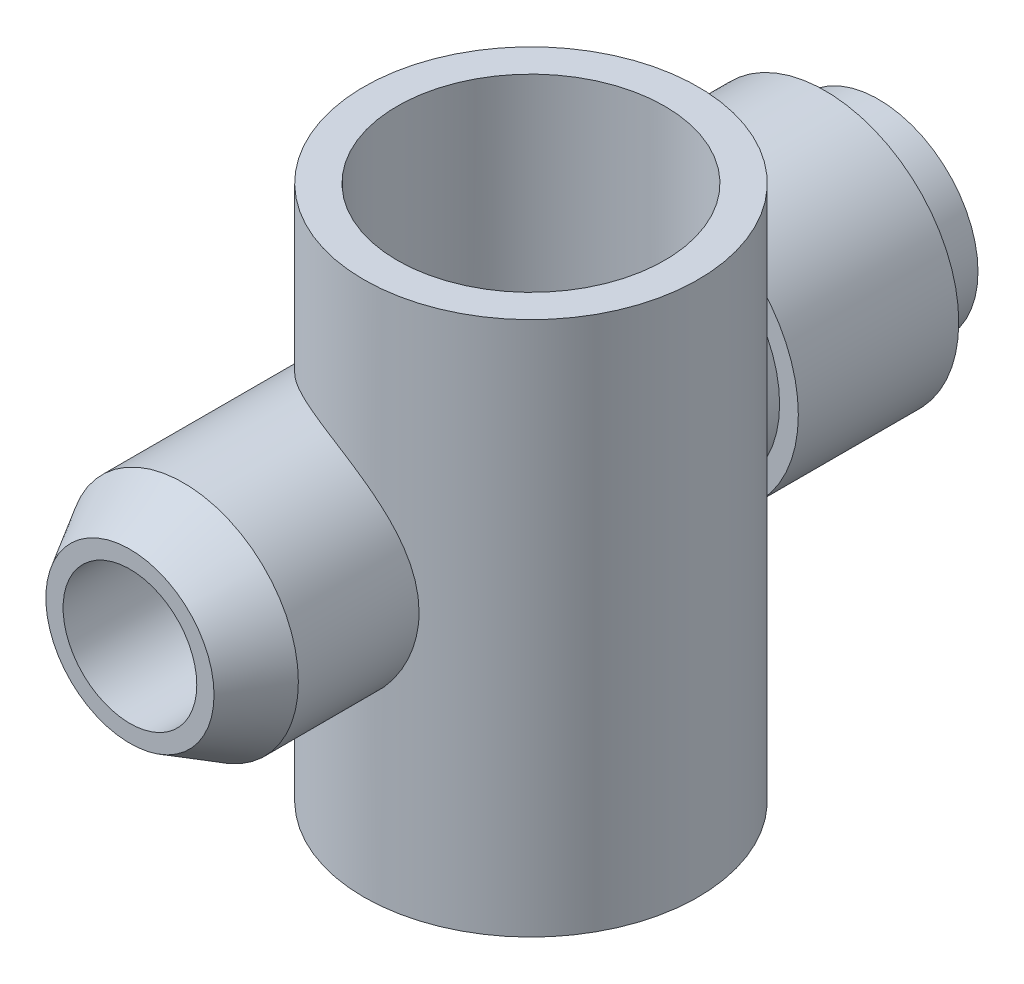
ISO-10303-21;
HEADER;
FILE_DESCRIPTION(('STEP AP214'),'2;1');
FILE_NAME('part.step','',(''),(''),'','','');
FILE_SCHEMA(('AUTOMOTIVE_DESIGN { 1 0 10303 214 1 1 1 1 }'));
ENDSEC;
DATA;
#1=APPLICATION_CONTEXT('core data for automotive mechanical design processes');
#2=APPLICATION_PROTOCOL_DEFINITION('international standard','automotive_design',2000,#1);
#3=PRODUCT_CONTEXT('',#1,'mechanical');
#4=PRODUCT('Part','Part','',(#3));
#5=PRODUCT_RELATED_PRODUCT_CATEGORY('part','',(#4));
#6=PRODUCT_DEFINITION_FORMATION('','',#4);
#7=PRODUCT_DEFINITION_CONTEXT('part definition',#1,'design');
#8=PRODUCT_DEFINITION('design','',#6,#7);
#9=PRODUCT_DEFINITION_SHAPE('','',#8);
#10=(LENGTH_UNIT() NAMED_UNIT(*) SI_UNIT(.MILLI.,.METRE.));
#11=(NAMED_UNIT(*) PLANE_ANGLE_UNIT() SI_UNIT($,.RADIAN.));
#12=(NAMED_UNIT(*) SI_UNIT($,.STERADIAN.) SOLID_ANGLE_UNIT());
#13=UNCERTAINTY_MEASURE_WITH_UNIT(LENGTH_MEASURE(1.E-05),#10,'distance_accuracy_value','');
#14=(GEOMETRIC_REPRESENTATION_CONTEXT(3) GLOBAL_UNCERTAINTY_ASSIGNED_CONTEXT((#13)) GLOBAL_UNIT_ASSIGNED_CONTEXT((#10,
#11,#12)) REPRESENTATION_CONTEXT('',''));
#15=CARTESIAN_POINT('',(0.,0.,0.));
#16=DIRECTION('',(0.,0.,1.));
#17=DIRECTION('',(1.,0.,0.));
#18=AXIS2_PLACEMENT_3D('',#15,#16,#17);
#19=CARTESIAN_POINT('',(0.,0.,10.16));
#20=DIRECTION('',(0.,0.,1.));
#21=DIRECTION('',(1.,0.,0.));
#22=AXIS2_PLACEMENT_3D('',#19,#20,#21);
#23=PLANE('',#22);
#24=CARTESIAN_POINT('',(0.,0.,10.16));
#25=DIRECTION('',(0.,0.,1.));
#26=DIRECTION('',(1.,0.,0.));
#27=AXIS2_PLACEMENT_3D('',#24,#25,#26);
#28=CIRCLE('',#27,6.35);
#29=CARTESIAN_POINT('',(-6.35,0.,10.16));
#30=VERTEX_POINT('',#29);
#31=EDGE_CURVE('E122',#30,#30,#28,.T.);
#32=ORIENTED_EDGE('',*,*,#31,.T.);
#33=EDGE_LOOP('',(#32));
#34=FACE_BOUND('',#33,.T.);
#35=CARTESIAN_POINT('',(0.,0.,10.16));
#36=DIRECTION('',(0.,0.,1.));
#37=DIRECTION('',(1.,0.,0.));
#38=AXIS2_PLACEMENT_3D('',#35,#36,#37);
#39=CIRCLE('',#38,5.461);
#40=CARTESIAN_POINT('',(5.461,0.,10.16));
#41=VERTEX_POINT('',#40);
#42=EDGE_CURVE('E129',#41,#41,#39,.T.);
#43=ORIENTED_EDGE('',*,*,#42,.F.);
#44=EDGE_LOOP('',(#43));
#45=FACE_BOUND('',#44,.T.);
#46=ADVANCED_FACE('F31',(#34,#45),#23,.T.);
#47=CARTESIAN_POINT('',(0.,0.,2.54));
#48=DIRECTION('',(0.,0.,-1.));
#49=DIRECTION('',(-1.,0.,0.));
#50=AXIS2_PLACEMENT_3D('',#47,#48,#49);
#51=CYLINDRICAL_SURFACE('',#50,4.7244);
#52=CARTESIAN_POINT('',(0.,0.,2.54));
#53=DIRECTION('',(0.,0.,1.));
#54=DIRECTION('',(1.,0.,0.));
#55=AXIS2_PLACEMENT_3D('',#52,#53,#54);
#56=CIRCLE('',#55,4.7244);
#57=CARTESIAN_POINT('',(4.7244,0.,2.54));
#58=VERTEX_POINT('',#57);
#59=EDGE_CURVE('E53',#58,#58,#56,.T.);
#60=ORIENTED_EDGE('',*,*,#59,.F.);
#61=EDGE_LOOP('',(#60));
#62=FACE_BOUND('',#61,.T.);
#63=CARTESIAN_POINT('',(0.,0.,0.));
#64=DIRECTION('',(0.,0.,1.));
#65=DIRECTION('',(1.,0.,0.));
#66=AXIS2_PLACEMENT_3D('',#63,#64,#65);
#67=CIRCLE('',#66,4.7244);
#68=CARTESIAN_POINT('',(4.7244,0.,0.));
#69=VERTEX_POINT('',#68);
#70=EDGE_CURVE('E57',#69,#69,#67,.T.);
#71=ORIENTED_EDGE('',*,*,#70,.T.);
#72=EDGE_LOOP('',(#71));
#73=FACE_BOUND('',#72,.T.);
#74=ADVANCED_FACE('F92',(#62,#73),#51,.T.);
#75=CARTESIAN_POINT('',(0.,0.,0.));
#76=DIRECTION('',(0.,0.,1.));
#77=DIRECTION('',(1.,0.,0.));
#78=AXIS2_PLACEMENT_3D('',#75,#76,#77);
#79=PLANE('',#78);
#80=CARTESIAN_POINT('',(0.,0.,0.));
#81=DIRECTION('',(0.,0.,1.));
#82=DIRECTION('',(1.,0.,0.));
#83=AXIS2_PLACEMENT_3D('',#80,#81,#82);
#84=CIRCLE('',#83,3.175);
#85=CARTESIAN_POINT('',(3.175,0.,0.));
#86=VERTEX_POINT('',#85);
#87=EDGE_CURVE('E48',#86,#86,#84,.T.);
#88=ORIENTED_EDGE('',*,*,#87,.T.);
#89=EDGE_LOOP('',(#88));
#90=FACE_BOUND('',#89,.T.);
#91=ORIENTED_EDGE('',*,*,#70,.F.);
#92=EDGE_LOOP('',(#91));
#93=FACE_BOUND('',#92,.T.);
#94=ADVANCED_FACE('F98',(#90,#93),#79,.F.);
#95=CARTESIAN_POINT('',(0.,0.,2.54));
#96=DIRECTION('',(0.,0.,1.));
#97=DIRECTION('',(1.,0.,0.));
#98=AXIS2_PLACEMENT_3D('',#95,#96,#97);
#99=PLANE('',#98);
#100=CARTESIAN_POINT('',(0.,0.,2.54));
#101=DIRECTION('',(0.,0.,1.));
#102=DIRECTION('',(1.,0.,0.));
#103=AXIS2_PLACEMENT_3D('',#100,#101,#102);
#104=CIRCLE('',#103,6.35);
#105=CARTESIAN_POINT('',(-6.35,0.,2.54));
#106=VERTEX_POINT('',#105);
#107=EDGE_CURVE('E124',#106,#106,#104,.T.);
#108=ORIENTED_EDGE('',*,*,#107,.F.);
#109=EDGE_LOOP('',(#108));
#110=FACE_BOUND('',#109,.T.);
#111=ORIENTED_EDGE('',*,*,#59,.T.);
#112=EDGE_LOOP('',(#111));
#113=FACE_BOUND('',#112,.T.);
#114=ADVANCED_FACE('F104',(#110,#113),#99,.F.);
#115=CARTESIAN_POINT('',(0.,0.,10.16));
#116=DIRECTION('',(0.,0.,-1.));
#117=DIRECTION('',(-1.,0.,0.));
#118=AXIS2_PLACEMENT_3D('',#115,#116,#117);
#119=CYLINDRICAL_SURFACE('',#118,6.35);
#120=CARTESIAN_POINT('',(-6.35,0.,10.16));
#121=CARTESIAN_POINT('',(-6.35,0.,10.080625));
#122=CARTESIAN_POINT('',(-6.35,0.,10.00125));
#123=CARTESIAN_POINT('',(-6.35,0.,9.8425));
#124=CARTESIAN_POINT('',(-6.35,0.,9.763125));
#125=CARTESIAN_POINT('',(-6.35,0.,9.604375));
#126=CARTESIAN_POINT('',(-6.35,0.,9.525));
#127=CARTESIAN_POINT('',(-6.35,0.,9.36625));
#128=CARTESIAN_POINT('',(-6.35,0.,9.286875));
#129=CARTESIAN_POINT('',(-6.35,0.,9.128125));
#130=CARTESIAN_POINT('',(-6.35,0.,9.04875));
#131=CARTESIAN_POINT('',(-6.35,0.,8.89));
#132=CARTESIAN_POINT('',(-6.35,0.,8.810625));
#133=CARTESIAN_POINT('',(-6.35,0.,8.651875));
#134=CARTESIAN_POINT('',(-6.35,0.,8.5725));
#135=CARTESIAN_POINT('',(-6.35,0.,8.41375));
#136=CARTESIAN_POINT('',(-6.35,0.,8.334375));
#137=CARTESIAN_POINT('',(-6.35,0.,8.175625));
#138=CARTESIAN_POINT('',(-6.35,0.,8.09625));
#139=CARTESIAN_POINT('',(-6.35,0.,7.9375));
#140=CARTESIAN_POINT('',(-6.35,0.,7.858125));
#141=CARTESIAN_POINT('',(-6.35,0.,7.699375));
#142=CARTESIAN_POINT('',(-6.35,0.,7.62));
#143=CARTESIAN_POINT('',(-6.35,0.,7.46125));
#144=CARTESIAN_POINT('',(-6.35,0.,7.381875));
#145=CARTESIAN_POINT('',(-6.35,0.,7.223125));
#146=CARTESIAN_POINT('',(-6.35,0.,7.14375));
#147=CARTESIAN_POINT('',(-6.35,0.,6.985));
#148=CARTESIAN_POINT('',(-6.35,0.,6.905625));
#149=CARTESIAN_POINT('',(-6.35,0.,6.746875));
#150=CARTESIAN_POINT('',(-6.35,0.,6.6675));
#151=CARTESIAN_POINT('',(-6.35,0.,6.50875));
#152=CARTESIAN_POINT('',(-6.35,0.,6.429375));
#153=CARTESIAN_POINT('',(-6.35,0.,6.270625));
#154=CARTESIAN_POINT('',(-6.35,0.,6.19125));
#155=CARTESIAN_POINT('',(-6.35,0.,6.0325));
#156=CARTESIAN_POINT('',(-6.35,0.,5.953125));
#157=CARTESIAN_POINT('',(-6.35,0.,5.794375));
#158=CARTESIAN_POINT('',(-6.35,0.,5.715));
#159=CARTESIAN_POINT('',(-6.35,0.,5.55625));
#160=CARTESIAN_POINT('',(-6.35,0.,5.476875));
#161=CARTESIAN_POINT('',(-6.35,0.,5.318125));
#162=CARTESIAN_POINT('',(-6.35,0.,5.23875));
#163=CARTESIAN_POINT('',(-6.35,0.,5.08));
#164=CARTESIAN_POINT('',(-6.35,0.,5.000625));
#165=CARTESIAN_POINT('',(-6.35,0.,4.841875));
#166=CARTESIAN_POINT('',(-6.35,0.,4.7625));
#167=CARTESIAN_POINT('',(-6.35,0.,4.60375));
#168=CARTESIAN_POINT('',(-6.35,0.,4.524375));
#169=CARTESIAN_POINT('',(-6.35,0.,4.365625));
#170=CARTESIAN_POINT('',(-6.35,0.,4.28625));
#171=CARTESIAN_POINT('',(-6.35,0.,4.1275));
#172=CARTESIAN_POINT('',(-6.35,0.,4.048125));
#173=CARTESIAN_POINT('',(-6.35,0.,3.889375));
#174=CARTESIAN_POINT('',(-6.35,0.,3.81));
#175=CARTESIAN_POINT('',(-6.35,0.,3.65125));
#176=CARTESIAN_POINT('',(-6.35,0.,3.571875));
#177=CARTESIAN_POINT('',(-6.35,0.,3.413125));
#178=CARTESIAN_POINT('',(-6.35,0.,3.33375));
#179=CARTESIAN_POINT('',(-6.35,0.,3.175));
#180=CARTESIAN_POINT('',(-6.35,0.,3.095625));
#181=CARTESIAN_POINT('',(-6.35,0.,2.936875));
#182=CARTESIAN_POINT('',(-6.35,0.,2.8575));
#183=CARTESIAN_POINT('',(-6.35,0.,2.69875));
#184=CARTESIAN_POINT('',(-6.35,0.,2.619375));
#185=CARTESIAN_POINT('',(-6.35,0.,2.54));
#186=B_SPLINE_CURVE_WITH_KNOTS('',3,(#120,#121,#122,#123,#124,#125,#126,#127,#128,#129,#130,
#131,#132,#133,#134,#135,#136,#137,#138,#139,#140,#141,#142,#143,#144,#145,#146,#147,#148,#149,
#150,#151,#152,#153,#154,#155,#156,#157,#158,#159,#160,#161,#162,#163,#164,#165,#166,#167,#168,
#169,#170,#171,#172,#173,#174,#175,#176,#177,#178,#179,#180,#181,#182,#183,#184,#185),
.UNSPECIFIED.,.F.,.F.,(4,2,2,2,2,2,2,2,2,2,2,2,2,2,2,2,2,2,2,2,2,2,2,2,2,2,2,2,2,2,2,2,4),(0.,
0.238124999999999,0.476249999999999,0.714375,0.952499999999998,1.190625,1.42875,1.666875,1.905,
2.143125,2.38125,2.619375,2.8575,3.095625,3.33375,3.571875,3.81,4.048125,4.28625,4.524375,
4.7625,5.000625,5.23875,5.476875,5.715,5.953125,6.19125,6.429375,6.6675,6.905625,7.14375,
7.381875,7.62),.UNSPECIFIED.);
#187=EDGE_CURVE('BSEAM105',#30,#106,#186,.T.);
#188=ORIENTED_EDGE('',*,*,#31,.F.);
#189=ORIENTED_EDGE('',*,*,#107,.T.);
#190=ORIENTED_EDGE('',*,*,#187,.T.);
#191=ORIENTED_EDGE('',*,*,#187,.F.);
#192=EDGE_LOOP('',(#188,#190,#189,#191));
#193=FACE_BOUND('',#192,.T.);
#194=ADVANCED_FACE('F105',(#193),#119,.T.);
#195=CARTESIAN_POINT('',(0.,0.,35.56));
#196=DIRECTION('',(0.,0.,-1.));
#197=DIRECTION('',(-1.,0.,0.));
#198=AXIS2_PLACEMENT_3D('',#195,#196,#197);
#199=CYLINDRICAL_SURFACE('',#198,5.461);
#200=CARTESIAN_POINT('',(0.,0.,33.02));
#201=DIRECTION('',(0.,0.,1.));
#202=DIRECTION('',(1.,0.,0.));
#203=AXIS2_PLACEMENT_3D('',#200,#201,#202);
#204=CIRCLE('',#203,5.461);
#205=CARTESIAN_POINT('',(5.461,0.,33.02));
#206=VERTEX_POINT('',#205);
#207=EDGE_CURVE('E11',#206,#206,#204,.F.);
#208=ORIENTED_EDGE('',*,*,#207,.T.);
#209=EDGE_LOOP('',(#208));
#210=FACE_BOUND('',#209,.T.);
#211=CARTESIAN_POINT('',(3.175,-4.44318534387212,27.6225));
#212=CARTESIAN_POINT('',(3.29795933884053,-4.35532039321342,27.6224999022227));
#213=CARTESIAN_POINT('',(3.41726799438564,-4.26234424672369,27.6196385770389));
#214=CARTESIAN_POINT('',(3.64767621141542,-4.06692027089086,27.6092541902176));
#215=CARTESIAN_POINT('',(3.75877169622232,-3.96446779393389,27.6017288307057));
#216=CARTESIAN_POINT('',(4.07847458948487,-3.64409583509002,27.5738112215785));
#217=CARTESIAN_POINT('',(4.27369213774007,-3.41302292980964,27.5480740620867));
#218=CARTESIAN_POINT('',(4.62269003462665,-2.92294333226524,27.4913727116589));
#219=CARTESIAN_POINT('',(4.77656504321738,-2.66400238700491,27.4604207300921));
#220=CARTESIAN_POINT('',(4.97398197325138,-2.25934031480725,27.4162402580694));
#221=CARTESIAN_POINT('',(5.03423995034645,-2.1216833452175,27.4018824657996));
#222=CARTESIAN_POINT('',(5.14324818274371,-1.84175194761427,27.37480308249));
#223=CARTESIAN_POINT('',(5.19200282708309,-1.69947930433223,27.3620808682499));
#224=CARTESIAN_POINT('',(5.27874622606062,-1.40753104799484,27.3387721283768));
#225=CARTESIAN_POINT('',(5.31642785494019,-1.25775916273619,27.3282485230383));
#226=CARTESIAN_POINT('',(5.37899868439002,-0.955368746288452,27.310441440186));
#227=CARTESIAN_POINT('',(5.40388771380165,-0.802750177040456,27.3031580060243));
#228=CARTESIAN_POINT('',(5.44063591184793,-0.495861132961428,27.2923102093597));
#229=CARTESIAN_POINT('',(5.45249863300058,-0.341591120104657,27.2887448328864));
#230=CARTESIAN_POINT('',(5.46309079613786,-0.0325631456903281,27.2855643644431));
#231=CARTESIAN_POINT('',(5.46182072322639,0.122194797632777,27.2859491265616));
#232=CARTESIAN_POINT('',(5.44647337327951,0.424834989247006,27.2905488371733));
#233=CARTESIAN_POINT('',(5.43290767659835,0.57274581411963,27.2946107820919));
#234=CARTESIAN_POINT('',(5.39380404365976,0.866836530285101,27.3061041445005));
#235=CARTESIAN_POINT('',(5.36826638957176,1.01301646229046,27.3135354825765));
#236=CARTESIAN_POINT('',(5.30542863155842,1.30265160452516,27.3313224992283));
#237=CARTESIAN_POINT('',(5.26812831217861,1.44610676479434,27.3416782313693));
#238=CARTESIAN_POINT('',(5.18206038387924,1.72936804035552,27.3646863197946));
#239=CARTESIAN_POINT('',(5.13328827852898,1.86917270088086,27.3773395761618));
#240=CARTESIAN_POINT('',(4.96932815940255,2.28410423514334,27.417862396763));
#241=CARTESIAN_POINT('',(4.83700197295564,2.55242661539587,27.448131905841));
#242=CARTESIAN_POINT('',(4.53021851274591,3.06409048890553,27.5075026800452));
#243=CARTESIAN_POINT('',(4.35574606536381,3.30742294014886,27.5366035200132));
#244=CARTESIAN_POINT('',(4.0624500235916,3.65280061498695,27.573377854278));
#245=CARTESIAN_POINT('',(3.95738805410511,3.76637265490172,27.584615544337));
#246=CARTESIAN_POINT('',(3.73785253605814,3.98432771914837,27.603284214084));
#247=CARTESIAN_POINT('',(3.62338328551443,4.08871489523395,27.6107169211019));
#248=CARTESIAN_POINT('',(3.3858983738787,4.28744500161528,27.6205873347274));
#249=CARTESIAN_POINT('',(3.26288571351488,4.38179142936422,27.6230267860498));
#250=CARTESIAN_POINT('',(3.00929982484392,4.55967224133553,27.6217825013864));
#251=CARTESIAN_POINT('',(2.87872734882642,4.64320769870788,27.6180993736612));
#252=CARTESIAN_POINT('',(2.62022050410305,4.79351649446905,27.60407447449));
#253=CARTESIAN_POINT('',(2.49269591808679,4.86103805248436,27.5941955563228));
#254=CARTESIAN_POINT('',(2.23329395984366,4.98554021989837,27.5675179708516));
#255=CARTESIAN_POINT('',(2.10141678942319,5.04252131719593,27.5507196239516));
#256=CARTESIAN_POINT('',(1.83467828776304,5.14557171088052,27.5096815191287));
#257=CARTESIAN_POINT('',(1.6998186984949,5.19164720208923,27.4854460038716));
#258=CARTESIAN_POINT('',(1.42842251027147,5.27277781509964,27.4291960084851));
#259=CARTESIAN_POINT('',(1.29188601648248,5.30783362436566,27.3971820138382));
#260=CARTESIAN_POINT('',(1.03110004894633,5.36427878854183,27.3285644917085));
#261=CARTESIAN_POINT('',(0.906874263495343,5.38662787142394,27.292652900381));
#262=CARTESIAN_POINT('',(0.659147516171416,5.42251917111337,27.2143605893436));
#263=CARTESIAN_POINT('',(0.535646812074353,5.43605842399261,27.171977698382));
#264=CARTESIAN_POINT('',(0.29037671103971,5.45466098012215,27.0809423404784));
#265=CARTESIAN_POINT('',(0.168606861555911,5.45972654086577,27.032291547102));
#266=CARTESIAN_POINT('',(-0.0724637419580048,5.46185029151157,26.9289695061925));
#267=CARTESIAN_POINT('',(-0.191763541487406,5.45890544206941,26.87429598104));
#268=CARTESIAN_POINT('',(-0.431460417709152,5.44529990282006,26.7571834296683));
#269=CARTESIAN_POINT('',(-0.551738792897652,5.43436169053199,26.6945338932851));
#270=CARTESIAN_POINT('',(-0.788267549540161,5.40512478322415,26.5635699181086));
#271=CARTESIAN_POINT('',(-0.904516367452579,5.38682326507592,26.4952533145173));
#272=CARTESIAN_POINT('',(-1.24645573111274,5.32190190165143,26.2824672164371));
#273=CARTESIAN_POINT('',(-1.46545640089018,5.26525736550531,26.1301038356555));
#274=CARTESIAN_POINT('',(-1.83431129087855,5.14647513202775,25.8455011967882));
#275=CARTESIAN_POINT('',(-1.98840867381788,5.0886717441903,25.716811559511));
#276=CARTESIAN_POINT('',(-2.28424919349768,4.96291911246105,25.4504239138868));
#277=CARTESIAN_POINT('',(-2.42598677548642,4.89496534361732,25.3127219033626));
#278=CARTESIAN_POINT('',(-2.83312428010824,4.67872372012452,24.8870070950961));
#279=CARTESIAN_POINT('',(-3.07974604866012,4.51830033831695,24.5869362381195));
#280=CARTESIAN_POINT('',(-3.44126555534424,4.24394707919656,24.0767528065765));
#281=CARTESIAN_POINT('',(-3.57117716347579,4.13472169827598,23.8743350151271));
#282=CARTESIAN_POINT('',(-3.81184602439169,3.91394605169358,23.4593135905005));
#283=CARTESIAN_POINT('',(-3.92259051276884,3.80239429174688,23.2467032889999));
#284=CARTESIAN_POINT('',(-4.12476421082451,3.58206005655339,22.8114804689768));
#285=CARTESIAN_POINT('',(-4.21621648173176,3.47327441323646,22.5888802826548));
#286=CARTESIAN_POINT('',(-4.37955191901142,3.26488926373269,22.1327205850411));
#287=CARTESIAN_POINT('',(-4.45145734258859,3.16527939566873,21.8991738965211));
#288=CARTESIAN_POINT('',(-4.57313666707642,2.98669533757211,21.4252576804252));
#289=CARTESIAN_POINT('',(-4.62341257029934,2.90727287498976,21.1851983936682));
#290=CARTESIAN_POINT('',(-4.68233129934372,2.81064666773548,20.8170839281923));
#291=CARTESIAN_POINT('',(-4.69920540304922,2.7822215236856,20.6932810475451));
#292=CARTESIAN_POINT('',(-4.72719161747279,2.73440092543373,20.4433321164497));
#293=CARTESIAN_POINT('',(-4.73830715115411,2.7150001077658,20.3171875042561));
#294=CARTESIAN_POINT('',(-4.75461012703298,2.68635211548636,20.0615741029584));
#295=CARTESIAN_POINT('',(-4.75971372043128,2.67724862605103,19.9320834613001));
#296=CARTESIAN_POINT('',(-4.76354984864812,2.6704176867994,19.6727114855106));
#297=CARTESIAN_POINT('',(-4.76228293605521,2.67268925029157,19.5428301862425));
#298=CARTESIAN_POINT('',(-4.75341215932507,2.68843291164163,19.283713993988));
#299=CARTESIAN_POINT('',(-4.7457952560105,2.70192805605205,19.1544809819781));
#300=CARTESIAN_POINT('',(-4.72443826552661,2.73909768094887,18.8980076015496));
#301=CARTESIAN_POINT('',(-4.71069654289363,2.76277488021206,18.770767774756));
#302=CARTESIAN_POINT('',(-4.6724969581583,2.82702413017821,18.4817673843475));
#303=CARTESIAN_POINT('',(-4.64607200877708,2.87052155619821,18.3209228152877));
#304=CARTESIAN_POINT('',(-4.58421368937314,2.96830623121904,18.0043567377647));
#305=CARTESIAN_POINT('',(-4.54877601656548,3.02259863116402,17.8486377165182));
#306=CARTESIAN_POINT('',(-4.46928329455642,3.13895071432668,17.5416162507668));
#307=CARTESIAN_POINT('',(-4.42519140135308,3.20104318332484,17.3903359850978));
#308=CARTESIAN_POINT('',(-4.32885910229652,3.33016526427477,17.0926113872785));
#309=CARTESIAN_POINT('',(-4.27661914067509,3.39719460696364,16.946166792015));
#310=CARTESIAN_POINT('',(-4.13177487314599,3.57357017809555,16.5746088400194));
#311=CARTESIAN_POINT('',(-4.03325747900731,3.68504373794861,16.3527909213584));
#312=CARTESIAN_POINT('',(-3.81661327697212,3.90900743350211,15.9193716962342));
#313=CARTESIAN_POINT('',(-3.69847599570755,4.02149808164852,15.7077759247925));
#314=CARTESIAN_POINT('',(-3.44265177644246,4.24254320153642,15.2953192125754));
#315=CARTESIAN_POINT('',(-3.30501092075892,4.35110621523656,15.0944344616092));
#316=CARTESIAN_POINT('',(-3.00976420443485,4.56033020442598,14.7037790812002));
#317=CARTESIAN_POINT('',(-2.85217092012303,4.66099609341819,14.5140015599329));
#318=CARTESIAN_POINT('',(-2.4592282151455,4.88276516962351,14.0840694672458));
#319=CARTESIAN_POINT('',(-2.21567045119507,4.99916218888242,13.8487542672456));
#320=CARTESIAN_POINT('',(-1.82369368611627,5.14939337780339,13.5168305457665));
#321=CARTESIAN_POINT('',(-1.68863201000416,5.19540121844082,13.4097217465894));
#322=CARTESIAN_POINT('',(-1.40987671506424,5.27786606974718,13.2032681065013));
#323=CARTESIAN_POINT('',(-1.26618472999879,5.31432488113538,13.1039218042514));
#324=CARTESIAN_POINT('',(-0.998177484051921,5.37040833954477,12.9315576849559));
#325=CARTESIAN_POINT('',(-0.87519509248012,5.39189947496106,12.8570691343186));
#326=CARTESIAN_POINT('',(-0.624483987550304,5.4266515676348,12.714446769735));
#327=CARTESIAN_POINT('',(-0.496756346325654,5.43991437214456,12.6463115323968));
#328=CARTESIAN_POINT('',(-0.237293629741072,5.45739055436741,12.5169344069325));
#329=CARTESIAN_POINT('',(-0.1055599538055,5.46160705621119,12.4556901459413));
#330=CARTESIAN_POINT('',(0.161046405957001,5.46025200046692,12.3405414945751));
#331=CARTESIAN_POINT('',(0.295919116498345,5.45468035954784,12.2866371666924));
#332=CARTESIAN_POINT('',(0.568554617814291,5.43305447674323,12.1862279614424));
#333=CARTESIAN_POINT('',(0.706330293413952,5.41693414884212,12.1397720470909));
#334=CARTESIAN_POINT('',(0.982640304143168,5.37368503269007,12.0549048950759));
#335=CARTESIAN_POINT('',(1.12117464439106,5.34655617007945,12.0164937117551));
#336=CARTESIAN_POINT('',(1.3975598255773,5.28105224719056,11.9477596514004));
#337=CARTESIAN_POINT('',(1.53541080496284,5.24267956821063,11.9174350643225));
#338=CARTESIAN_POINT('',(1.80900545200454,5.15467412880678,11.8646820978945));
#339=CARTESIAN_POINT('',(1.94474927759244,5.1050422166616,11.842253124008));
#340=CARTESIAN_POINT('',(2.19898787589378,5.00038924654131,11.8067984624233));
#341=CARTESIAN_POINT('',(2.31782524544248,4.94644095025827,11.7930449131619));
#342=CARTESIAN_POINT('',(2.55177075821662,4.82991413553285,11.7711324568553));
#343=CARTESIAN_POINT('',(2.66687764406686,4.76733274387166,11.7629754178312));
#344=CARTESIAN_POINT('',(2.8924359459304,4.63394995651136,11.7517276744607));
#345=CARTESIAN_POINT('',(3.00288874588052,4.56315102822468,11.7486354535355));
#346=CARTESIAN_POINT('',(3.21845414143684,4.41376251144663,11.7468858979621));
#347=CARTESIAN_POINT('',(3.3235646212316,4.33516987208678,11.7482303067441));
#348=CARTESIAN_POINT('',(3.63656180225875,4.08303032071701,11.7581280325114));
#349=CARTESIAN_POINT('',(3.83475631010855,3.89745693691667,11.7728314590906));
#350=CARTESIAN_POINT('',(4.20105181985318,3.49956082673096,11.8119325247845));
#351=CARTESIAN_POINT('',(4.36913815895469,3.28722515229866,11.8363348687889));
#352=CARTESIAN_POINT('',(4.6040115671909,2.9407135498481,11.8767348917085));
#353=CARTESIAN_POINT('',(4.68244299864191,2.81414347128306,11.891599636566));
#354=CARTESIAN_POINT('',(4.82870736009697,2.55503736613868,11.9213198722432));
#355=CARTESIAN_POINT('',(4.8965434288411,2.42250312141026,11.9361753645));
#356=CARTESIAN_POINT('',(5.02123145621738,2.15219089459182,11.9649330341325));
#357=CARTESIAN_POINT('',(5.07807802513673,2.01441037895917,11.9788347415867));
#358=CARTESIAN_POINT('',(5.18034742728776,1.73456164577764,12.0048130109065));
#359=CARTESIAN_POINT('',(5.22577463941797,1.59249509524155,12.0168902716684));
#360=CARTESIAN_POINT('',(5.30620178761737,1.30018198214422,12.0388451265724));
#361=CARTESIAN_POINT('',(5.34080768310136,1.14982023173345,12.0486368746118));
#362=CARTESIAN_POINT('',(5.39719444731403,0.84652499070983,12.06485427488));
#363=CARTESIAN_POINT('',(5.41897501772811,0.693591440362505,12.0712798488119));
#364=CARTESIAN_POINT('',(5.44950170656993,0.386361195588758,12.08034332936));
#365=CARTESIAN_POINT('',(5.45825172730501,0.232064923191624,12.0829823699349));
#366=CARTESIAN_POINT('',(5.46264357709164,-0.0767273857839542,12.0843027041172));
#367=CARTESIAN_POINT('',(5.45828589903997,-0.231223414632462,12.0829841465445));
#368=CARTESIAN_POINT('',(5.43694914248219,-0.53296000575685,12.0766094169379));
#369=CARTESIAN_POINT('',(5.42048874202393,-0.680240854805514,12.0717068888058));
#370=CARTESIAN_POINT('',(5.37567950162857,-0.972888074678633,12.0586338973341));
#371=CARTESIAN_POINT('',(5.34732641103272,-1.11825374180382,12.0504622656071));
#372=CARTESIAN_POINT('',(5.27897036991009,-1.40600866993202,12.0313425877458));
#373=CARTESIAN_POINT('',(5.23896891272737,-1.54839830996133,12.020394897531));
#374=CARTESIAN_POINT('',(5.147603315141,-1.82935262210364,11.996373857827));
#375=CARTESIAN_POINT('',(5.09623505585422,-1.96791588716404,11.9832997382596));
#376=CARTESIAN_POINT('',(4.98173472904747,-2.24214503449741,11.955632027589));
#377=CARTESIAN_POINT('',(4.91845378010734,-2.37774691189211,11.9410203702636));
#378=CARTESIAN_POINT('',(4.78100557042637,-2.643266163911,11.9113526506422));
#379=CARTESIAN_POINT('',(4.70683814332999,-2.77318345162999,11.8962965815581));
#380=CARTESIAN_POINT('',(4.54802358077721,-3.02661124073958,11.8667369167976));
#381=CARTESIAN_POINT('',(4.46337096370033,-3.15011834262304,11.8522336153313));
#382=CARTESIAN_POINT('',(4.28414630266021,-3.38983774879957,11.8248528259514));
#383=CARTESIAN_POINT('',(4.18957786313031,-3.50605267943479,11.8119747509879));
#384=CARTESIAN_POINT('',(3.98798505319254,-3.73394525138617,11.7885722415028));
#385=CARTESIAN_POINT('',(3.88066590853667,-3.84537140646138,11.7781329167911));
#386=CARTESIAN_POINT('',(3.6568335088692,-4.05881650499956,11.7613437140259));
#387=CARTESIAN_POINT('',(3.54032447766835,-4.16083972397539,11.7549919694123));
#388=CARTESIAN_POINT('',(3.29899749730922,-4.3546613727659,11.7475511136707));
#389=CARTESIAN_POINT('',(3.17418299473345,-4.44646400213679,11.7464598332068));
#390=CARTESIAN_POINT('',(2.9172758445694,-4.61908690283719,11.7506456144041));
#391=CARTESIAN_POINT('',(2.78518396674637,-4.69990833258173,11.7559220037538));
#392=CARTESIAN_POINT('',(2.52485905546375,-4.84439120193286,11.7731748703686));
#393=CARTESIAN_POINT('',(2.39704756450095,-4.9088743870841,11.7846344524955));
#394=CARTESIAN_POINT('',(2.13743554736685,-5.02734958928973,11.814521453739));
#395=CARTESIAN_POINT('',(2.00563522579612,-5.08134214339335,11.8329485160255));
#396=CARTESIAN_POINT('',(1.73940371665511,-5.17851981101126,11.8772365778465));
#397=CARTESIAN_POINT('',(1.60497390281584,-5.2217104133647,11.9030937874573));
#398=CARTESIAN_POINT('',(1.33477904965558,-5.29722187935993,11.9625248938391));
#399=CARTESIAN_POINT('',(1.19901408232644,-5.32954332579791,11.9960983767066));
#400=CARTESIAN_POINT('',(0.939415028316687,-5.38107526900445,12.0677444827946));
#401=CARTESIAN_POINT('',(0.815577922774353,-5.40118644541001,12.1051650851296));
#402=CARTESIAN_POINT('',(0.568859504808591,-5.43271483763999,12.1864128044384));
#403=CARTESIAN_POINT('',(0.445978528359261,-5.44412912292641,12.2302420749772));
#404=CARTESIAN_POINT('',(0.202149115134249,-5.45862349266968,12.3240812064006));
#405=CARTESIAN_POINT('',(0.0812001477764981,-5.46170590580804,12.3740893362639));
#406=CARTESIAN_POINT('',(-0.158063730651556,-5.46002362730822,12.4800211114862));
#407=CARTESIAN_POINT('',(-0.276377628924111,-5.45525596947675,12.5359469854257));
#408=CARTESIAN_POINT('',(-0.515062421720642,-5.43803258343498,12.656059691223));
#409=CARTESIAN_POINT('',(-0.635276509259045,-5.4252324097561,12.7205085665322));
#410=CARTESIAN_POINT('',(-0.871495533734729,-5.39233302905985,12.8550447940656));
#411=CARTESIAN_POINT('',(-0.98749882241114,-5.37223099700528,12.9251343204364));
#412=CARTESIAN_POINT('',(-1.32850883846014,-5.30201842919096,13.1432115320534));
#413=CARTESIAN_POINT('',(-1.54658559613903,-5.24199563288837,13.2990432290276));
#414=CARTESIAN_POINT('',(-1.91491967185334,-5.11708036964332,13.5908342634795));
#415=CARTESIAN_POINT('',(-2.06939637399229,-5.056322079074,13.7233761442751));
#416=CARTESIAN_POINT('',(-2.36556562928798,-4.9247197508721,13.9975801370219));
#417=CARTESIAN_POINT('',(-2.50725219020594,-4.8538710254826,14.1392464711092));
#418=CARTESIAN_POINT('',(-2.77792966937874,-4.70421125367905,14.4308383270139));
#419=CARTESIAN_POINT('',(-2.9068938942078,-4.62538414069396,14.5807802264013));
#420=CARTESIAN_POINT('',(-3.15191276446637,-4.46202175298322,14.8878490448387));
#421=CARTESIAN_POINT('',(-3.26796922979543,-4.37748728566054,15.0449749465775));
#422=CARTESIAN_POINT('',(-3.49057201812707,-4.20226914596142,15.3705957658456));
#423=CARTESIAN_POINT('',(-3.59674362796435,-4.11147813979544,15.5392884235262));
#424=CARTESIAN_POINT('',(-3.79584642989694,-3.92840346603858,15.8835835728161));
#425=CARTESIAN_POINT('',(-3.88877485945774,-3.83611949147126,16.0591874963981));
#426=CARTESIAN_POINT('',(-4.06140382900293,-3.65285526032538,16.4173000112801));
#427=CARTESIAN_POINT('',(-4.14111138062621,-3.56187433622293,16.5998048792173));
#428=CARTESIAN_POINT('',(-4.28722085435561,-3.38458517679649,16.972219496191));
#429=CARTESIAN_POINT('',(-4.35362856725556,-3.29827491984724,17.1621259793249));
#430=CARTESIAN_POINT('',(-4.44982844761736,-3.16629834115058,17.4755927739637));
#431=CARTESIAN_POINT('',(-4.48388839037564,-3.11775238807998,17.5966250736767));
#432=CARTESIAN_POINT('',(-4.54659315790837,-3.0255762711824,17.8419105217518));
#433=CARTESIAN_POINT('',(-4.57523685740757,-2.98194712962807,17.966164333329));
#434=CARTESIAN_POINT('',(-4.65247737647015,-2.86114001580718,18.3433557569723));
#435=CARTESIAN_POINT('',(-4.69265047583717,-2.79365857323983,18.6015781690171));
#436=CARTESIAN_POINT('',(-4.73160138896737,-2.72671845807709,18.976322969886));
#437=CARTESIAN_POINT('',(-4.74089727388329,-2.71046170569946,19.0888840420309));
#438=CARTESIAN_POINT('',(-4.75468787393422,-2.68619899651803,19.3151675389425));
#439=CARTESIAN_POINT('',(-4.75918484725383,-2.67818915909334,19.4288893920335));
#440=CARTESIAN_POINT('',(-4.76326562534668,-2.67092487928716,19.6566092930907));
#441=CARTESIAN_POINT('',(-4.76285344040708,-2.67166329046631,19.7706070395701));
#442=CARTESIAN_POINT('',(-4.75713907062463,-2.68182404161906,19.9980942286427));
#443=CARTESIAN_POINT('',(-4.75183623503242,-2.69124753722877,20.1115836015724));
#444=CARTESIAN_POINT('',(-4.73464326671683,-2.72140473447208,20.3639727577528));
#445=CARTESIAN_POINT('',(-4.72149133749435,-2.744287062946,20.502530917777));
#446=CARTESIAN_POINT('',(-4.68829285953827,-2.80062460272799,20.7766121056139));
#447=CARTESIAN_POINT('',(-4.66824363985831,-2.83408390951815,20.9121339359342));
#448=CARTESIAN_POINT('',(-4.5982001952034,-2.94735148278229,21.3146299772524));
#449=CARTESIAN_POINT('',(-4.53839853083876,-3.03987094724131,21.5763303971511));
#450=CARTESIAN_POINT('',(-4.40437061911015,-3.23047063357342,22.053702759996));
#451=CARTESIAN_POINT('',(-4.3328527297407,-3.32643854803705,22.271058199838));
#452=CARTESIAN_POINT('',(-4.1726407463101,-3.52532507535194,22.6962570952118));
#453=CARTESIAN_POINT('',(-4.08393381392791,-3.62824884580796,22.9040932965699));
#454=CARTESIAN_POINT('',(-3.88961019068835,-3.83584386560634,23.3107377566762));
#455=CARTESIAN_POINT('',(-3.78399401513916,-3.94051506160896,23.5095462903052));
#456=CARTESIAN_POINT('',(-3.55575475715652,-4.14763503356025,23.8982645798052));
#457=CARTESIAN_POINT('',(-3.43313931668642,-4.25008478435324,24.0881782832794));
#458=CARTESIAN_POINT('',(-3.19201576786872,-4.43312439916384,24.4285343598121));
#459=CARTESIAN_POINT('',(-3.07609939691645,-4.51455432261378,24.5803625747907));
#460=CARTESIAN_POINT('',(-2.83193243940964,-4.67158979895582,24.8770692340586));
#461=CARTESIAN_POINT('',(-2.70367903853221,-4.74719401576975,25.021946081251));
#462=CARTESIAN_POINT('',(-2.43503951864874,-4.89042268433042,25.3036447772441));
#463=CARTESIAN_POINT('',(-2.29467712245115,-4.95806215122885,25.4404815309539));
#464=CARTESIAN_POINT('',(-2.00173396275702,-5.08339868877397,25.7053223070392));
#465=CARTESIAN_POINT('',(-1.84915816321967,-5.14109976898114,25.83332987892));
#466=CARTESIAN_POINT('',(-1.57248889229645,-5.23118095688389,26.0479902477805));
#467=CARTESIAN_POINT('',(-1.45101046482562,-5.26626946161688,26.1368857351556));
#468=CARTESIAN_POINT('',(-1.20186334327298,-5.32865123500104,26.3084302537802));
#469=CARTESIAN_POINT('',(-1.07419781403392,-5.3559484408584,26.3910824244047));
#470=CARTESIAN_POINT('',(-0.813160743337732,-5.40174469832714,26.5495310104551));
#471=CARTESIAN_POINT('',(-0.679789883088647,-5.42024479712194,26.625328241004));
#472=CARTESIAN_POINT('',(-0.408066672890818,-5.44744364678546,26.7694325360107));
#473=CARTESIAN_POINT('',(-0.269714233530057,-5.45614222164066,26.8377394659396));
#474=CARTESIAN_POINT('',(0.012240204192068,-5.46282259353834,26.966834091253));
#475=CARTESIAN_POINT('',(0.155878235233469,-5.46070726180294,27.027548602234));
#476=CARTESIAN_POINT('',(0.445925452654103,-5.44470040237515,27.1402169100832));
#477=CARTESIAN_POINT('',(0.592334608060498,-5.43080900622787,27.1921708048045));
#478=CARTESIAN_POINT('',(0.886324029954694,-5.39063510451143,27.2869541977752));
#479=CARTESIAN_POINT('',(1.03390361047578,-5.36435939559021,27.3297886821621));
#480=CARTESIAN_POINT('',(1.32862367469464,-5.29906167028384,27.4062676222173));
#481=CARTESIAN_POINT('',(1.47576418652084,-5.26004048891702,27.4399126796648));
#482=CARTESIAN_POINT('',(1.75865059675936,-5.17206078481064,27.4963598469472));
#483=CARTESIAN_POINT('',(1.89453057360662,-5.12388273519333,27.519711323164));
#484=CARTESIAN_POINT('',(2.16295725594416,-5.01647606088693,27.5588854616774));
#485=CARTESIAN_POINT('',(2.29550412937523,-4.95724799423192,27.5747085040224));
#486=CARTESIAN_POINT('',(2.55601715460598,-4.82808926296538,27.5994107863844));
#487=CARTESIAN_POINT('',(2.68398112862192,-4.75815359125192,27.6082867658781));
#488=CARTESIAN_POINT('',(2.9340985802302,-4.60812979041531,27.6198315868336));
#489=CARTESIAN_POINT('',(3.05625174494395,-4.52804111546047,27.6225000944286));
#490=CARTESIAN_POINT('',(3.175,-4.44318534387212,27.6225));
#491=B_SPLINE_CURVE_WITH_KNOTS('',3,(#211,#212,#213,#214,#215,#216,#217,#218,#219,#220,#221,
#222,#223,#224,#225,#226,#227,#228,#229,#230,#231,#232,#233,#234,#235,#236,#237,#238,#239,#240,
#241,#242,#243,#244,#245,#246,#247,#248,#249,#250,#251,#252,#253,#254,#255,#256,#257,#258,#259,
#260,#261,#262,#263,#264,#265,#266,#267,#268,#269,#270,#271,#272,#273,#274,#275,#276,#277,#278,
#279,#280,#281,#282,#283,#284,#285,#286,#287,#288,#289,#290,#291,#292,#293,#294,#295,#296,#297,
#298,#299,#300,#301,#302,#303,#304,#305,#306,#307,#308,#309,#310,#311,#312,#313,#314,#315,#316,
#317,#318,#319,#320,#321,#322,#323,#324,#325,#326,#327,#328,#329,#330,#331,#332,#333,#334,#335,
#336,#337,#338,#339,#340,#341,#342,#343,#344,#345,#346,#347,#348,#349,#350,#351,#352,#353,#354,
#355,#356,#357,#358,#359,#360,#361,#362,#363,#364,#365,#366,#367,#368,#369,#370,#371,#372,#373,
#374,#375,#376,#377,#378,#379,#380,#381,#382,#383,#384,#385,#386,#387,#388,#389,#390,#391,#392,
#393,#394,#395,#396,#397,#398,#399,#400,#401,#402,#403,#404,#405,#406,#407,#408,#409,#410,#411,
#412,#413,#414,#415,#416,#417,#418,#419,#420,#421,#422,#423,#424,#425,#426,#427,#428,#429,#430,
#431,#432,#433,#434,#435,#436,#437,#438,#439,#440,#441,#442,#443,#444,#445,#446,#447,#448,#449,
#450,#451,#452,#453,#454,#455,#456,#457,#458,#459,#460,#461,#462,#463,#464,#465,#466,#467,#468,
#469,#470,#471,#472,#473,#474,#475,#476,#477,#478,#479,#480,#481,#482,#483,#484,#485,#486,#487,
#488,#489,#490),.UNSPECIFIED.,.T.,.F.,(4,2,2,2,2,2,2,2,2,2,2,2,2,2,2,2,2,2,2,2,2,2,2,2,2,2,2,2,
2,2,2,2,2,2,2,2,2,2,2,2,2,2,2,2,2,2,2,2,2,2,2,2,2,2,2,2,2,2,2,2,2,2,2,2,2,2,2,2,2,2,2,2,2,2,2,2,
2,2,2,2,2,2,2,2,2,2,2,2,2,2,2,2,2,2,2,2,2,2,2,2,2,2,2,2,2,2,2,2,2,2,2,2,2,2,2,2,2,2,2,2,2,2,2,2,
2,2,2,2,2,2,2,2,2,2,2,2,2,2,2,4),(0.,0.453220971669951,0.906665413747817,1.81284885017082,
2.71693941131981,3.16936448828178,3.62161666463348,4.08543173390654,4.54925300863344,
5.01294775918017,5.47662538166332,5.92185431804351,6.36707276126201,6.81229935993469,
7.25770075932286,8.15556309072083,9.05374915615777,9.51860889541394,9.98325741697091,
10.4477435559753,10.9121835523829,11.345493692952,11.7787837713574,12.2118271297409,
12.6448434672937,13.0380746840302,13.4314381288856,13.8246967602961,14.2181046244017,
14.6258623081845,15.0337764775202,15.8492159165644,16.4751897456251,17.1014434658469,
18.3566947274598,19.1484582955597,19.9407471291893,20.7320834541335,21.5225149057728,
22.2934557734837,22.6774891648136,23.0612940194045,23.450390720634,23.8394536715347,
24.2293175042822,24.6192855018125,25.1245490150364,25.6300542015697,26.1377600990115,
26.6454383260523,27.445662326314,28.2463148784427,29.0451062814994,29.8433966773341,
30.9134027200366,31.4481371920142,31.9827707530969,32.4185017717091,32.8541349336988,
33.2896176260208,33.7251040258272,34.1633451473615,34.6015892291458,35.0397405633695,
35.4778588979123,35.8711002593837,36.2644728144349,36.6577275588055,37.051136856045,
37.8632993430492,38.67585628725,39.1243529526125,39.5727165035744,40.0212993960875,
40.469710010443,40.9329338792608,41.3961685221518,41.8592644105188,42.3223428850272,
42.7666537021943,43.2111234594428,43.6555362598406,44.1001103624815,44.5506618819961,
45.0012202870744,45.452015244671,45.9026469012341,46.3672154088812,46.8315716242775,
47.2957363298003,47.7598520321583,48.1901077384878,48.6203414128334,49.0503560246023,
49.4803475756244,49.8726610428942,50.2651066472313,50.6574425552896,51.0499267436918,
51.4605129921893,51.8712582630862,52.6925153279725,53.3289935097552,53.9657683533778,
54.6038520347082,55.2418456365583,55.8983927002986,56.5550765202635,57.2114109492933,
57.8674589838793,58.2715673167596,58.6757595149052,59.4812387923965,59.8232354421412,
60.165071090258,60.5066275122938,60.8482293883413,61.2706620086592,61.6932583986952,
62.542067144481,63.285617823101,64.0297260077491,64.7738115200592,65.5175636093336,
66.1400123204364,66.7626033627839,67.3840012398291,68.0051478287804,68.4684475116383,
68.9315126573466,69.3945226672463,69.8575409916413,70.3247253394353,70.791904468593,
71.2588275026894,71.7257199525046,72.1632124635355,72.600682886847,73.0383585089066,
73.476057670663),.UNSPECIFIED.);
#492=CARTESIAN_POINT('',(3.175,-4.44318534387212,27.6225));
#493=VERTEX_POINT('',#492);
#494=EDGE_CURVE('E65',#493,#493,#491,.T.);
#495=ORIENTED_EDGE('',*,*,#494,.T.);
#496=EDGE_LOOP('',(#495));
#497=FACE_BOUND('',#496,.T.);
#498=ORIENTED_EDGE('',*,*,#42,.T.);
#499=EDGE_LOOP('',(#498));
#500=FACE_BOUND('',#499,.T.);
#501=ADVANCED_FACE('F108',(#210,#497,#500),#199,.T.);
#502=CARTESIAN_POINT('',(0.,0.,35.56));
#503=DIRECTION('',(0.,0.,1.));
#504=DIRECTION('',(1.,0.,0.));
#505=AXIS2_PLACEMENT_3D('',#502,#503,#504);
#506=PLANE('',#505);
#507=CARTESIAN_POINT('',(0.,0.,35.56));
#508=DIRECTION('',(0.,0.,1.));
#509=DIRECTION('',(1.,0.,0.));
#510=AXIS2_PLACEMENT_3D('',#507,#508,#509);
#511=CIRCLE('',#510,3.99453031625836);
#512=CARTESIAN_POINT('',(3.99453031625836,0.,35.56));
#513=VERTEX_POINT('',#512);
#514=EDGE_CURVE('E38',#513,#513,#511,.T.);
#515=ORIENTED_EDGE('',*,*,#514,.T.);
#516=EDGE_LOOP('',(#515));
#517=FACE_BOUND('',#516,.T.);
#518=CARTESIAN_POINT('',(0.,0.,35.56));
#519=DIRECTION('',(0.,0.,1.));
#520=DIRECTION('',(1.,0.,0.));
#521=AXIS2_PLACEMENT_3D('',#518,#519,#520);
#522=CIRCLE('',#521,3.175);
#523=CARTESIAN_POINT('',(3.175,0.,35.56));
#524=VERTEX_POINT('',#523);
#525=EDGE_CURVE('E142',#524,#524,#522,.T.);
#526=ORIENTED_EDGE('',*,*,#525,.F.);
#527=EDGE_LOOP('',(#526));
#528=FACE_BOUND('',#527,.T.);
#529=ADVANCED_FACE('F147',(#517,#528),#506,.T.);
#530=CARTESIAN_POINT('',(3.175,-12.7,19.685));
#531=DIRECTION('',(0.,1.,0.));
#532=DIRECTION('',(0.,0.,1.));
#533=AXIS2_PLACEMENT_3D('',#530,#531,#532);
#534=CYLINDRICAL_SURFACE('',#533,7.9375);
#535=CARTESIAN_POINT('',(3.175,12.7,19.685));
#536=DIRECTION('',(0.,1.,0.));
#537=DIRECTION('',(0.,0.,1.));
#538=AXIS2_PLACEMENT_3D('',#535,#536,#537);
#539=CIRCLE('',#538,7.9375);
#540=CARTESIAN_POINT('',(3.175,12.7,27.6225));
#541=VERTEX_POINT('',#540);
#542=EDGE_CURVE('E135',#541,#541,#539,.T.);
#543=ORIENTED_EDGE('',*,*,#542,.F.);
#544=EDGE_LOOP('',(#543));
#545=FACE_BOUND('',#544,.T.);
#546=CARTESIAN_POINT('',(3.175,-12.7,19.685));
#547=DIRECTION('',(0.,1.,0.));
#548=DIRECTION('',(0.,0.,1.));
#549=AXIS2_PLACEMENT_3D('',#546,#547,#548);
#550=CIRCLE('',#549,7.9375);
#551=CARTESIAN_POINT('',(3.175,-12.7,27.6225));
#552=VERTEX_POINT('',#551);
#553=EDGE_CURVE('E132',#552,#552,#550,.T.);
#554=ORIENTED_EDGE('',*,*,#553,.T.);
#555=EDGE_LOOP('',(#554));
#556=FACE_BOUND('',#555,.T.);
#557=ORIENTED_EDGE('',*,*,#494,.F.);
#558=EDGE_LOOP('',(#557));
#559=FACE_BOUND('',#558,.T.);
#560=ADVANCED_FACE('F149',(#545,#556,#559),#534,.T.);
#561=CARTESIAN_POINT('',(3.175,-12.7,19.685));
#562=DIRECTION('',(0.,1.,0.));
#563=DIRECTION('',(0.,0.,1.));
#564=AXIS2_PLACEMENT_3D('',#561,#562,#563);
#565=PLANE('',#564);
#566=ORIENTED_EDGE('',*,*,#553,.F.);
#567=EDGE_LOOP('',(#566));
#568=FACE_BOUND('',#567,.T.);
#569=ADVANCED_FACE('F156',(#568),#565,.F.);
#570=CARTESIAN_POINT('',(3.175,12.7,19.685));
#571=DIRECTION('',(0.,1.,0.));
#572=DIRECTION('',(0.,0.,1.));
#573=AXIS2_PLACEMENT_3D('',#570,#571,#572);
#574=PLANE('',#573);
#575=CARTESIAN_POINT('',(3.175,12.7,19.685));
#576=DIRECTION('',(0.,1.,0.));
#577=DIRECTION('',(0.,0.,1.));
#578=AXIS2_PLACEMENT_3D('',#575,#576,#577);
#579=CIRCLE('',#578,6.35);
#580=CARTESIAN_POINT('',(3.175,12.7,26.035));
#581=VERTEX_POINT('',#580);
#582=EDGE_CURVE('E47',#581,#581,#579,.T.);
#583=ORIENTED_EDGE('',*,*,#582,.F.);
#584=EDGE_LOOP('',(#583));
#585=FACE_BOUND('',#584,.T.);
#586=ORIENTED_EDGE('',*,*,#542,.T.);
#587=EDGE_LOOP('',(#586));
#588=FACE_BOUND('',#587,.T.);
#589=ADVANCED_FACE('F89',(#585,#588),#574,.T.);
#590=CARTESIAN_POINT('',(3.175,-10.16,19.685));
#591=DIRECTION('',(0.,1.,0.));
#592=DIRECTION('',(0.,0.,1.));
#593=AXIS2_PLACEMENT_3D('',#590,#591,#592);
#594=CYLINDRICAL_SURFACE('',#593,6.35);
#595=CARTESIAN_POINT('',(-3.175,0.,19.685));
#596=CARTESIAN_POINT('',(-3.175,-0.000154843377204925,19.6850000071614));
#597=CARTESIAN_POINT('',(-3.17499998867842,-0.00030968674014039,19.6853641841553));
#598=CARTESIAN_POINT('',(-3.174999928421,-0.000721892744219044,19.6861430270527));
#599=CARTESIAN_POINT('',(-3.1749998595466,-0.000979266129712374,19.6864315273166));
#600=CARTESIAN_POINT('',(-3.17499949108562,-0.0019258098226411,19.687596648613));
#601=CARTESIAN_POINT('',(-3.17499899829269,-0.00261472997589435,19.6886477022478));
#602=CARTESIAN_POINT('',(-3.17499623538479,-0.00526925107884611,19.692594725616));
#603=CARTESIAN_POINT('',(-3.17499236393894,-0.0072353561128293,19.6953008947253));
#604=CARTESIAN_POINT('',(-3.17486952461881,-0.0496262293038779,19.7537726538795));
#605=CARTESIAN_POINT('',(-3.17398049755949,-0.090044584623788,19.8119644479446));
#606=CARTESIAN_POINT('',(-3.17064006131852,-0.171279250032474,19.9276464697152));
#607=CARTESIAN_POINT('',(-3.16817203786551,-0.212095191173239,19.9851225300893));
#608=CARTESIAN_POINT('',(-3.1617568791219,-0.292386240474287,20.0986073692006));
#609=CARTESIAN_POINT('',(-3.15785806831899,-0.331863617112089,20.1546062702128));
#610=CARTESIAN_POINT('',(-3.14858640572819,-0.410603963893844,20.2663043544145));
#611=CARTESIAN_POINT('',(-3.14321776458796,-0.449867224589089,20.3220039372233));
#612=CARTESIAN_POINT('',(-3.1237895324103,-0.574490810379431,20.4990165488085));
#613=CARTESIAN_POINT('',(-3.10694740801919,-0.659604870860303,20.6202388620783));
#614=CARTESIAN_POINT('',(-3.06599117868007,-0.829465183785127,20.863054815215));
#615=CARTESIAN_POINT('',(-3.04182407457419,-0.914204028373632,20.9846445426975));
#616=CARTESIAN_POINT('',(-2.99159244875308,-1.0658677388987,21.2034376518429));
#617=CARTESIAN_POINT('',(-2.96682004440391,-1.13303987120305,21.3007664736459));
#618=CARTESIAN_POINT('',(-2.91250406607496,-1.26613665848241,21.4946724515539));
#619=CARTESIAN_POINT('',(-2.88296927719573,-1.33206336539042,21.5912506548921));
#620=CARTESIAN_POINT('',(-2.81954540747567,-1.46146983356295,21.7821095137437));
#621=CARTESIAN_POINT('',(-2.78573692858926,-1.52497205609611,21.8764016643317));
#622=CARTESIAN_POINT('',(-2.71329193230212,-1.65043053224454,22.0642126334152));
#623=CARTESIAN_POINT('',(-2.67465354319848,-1.71238617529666,22.1577311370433));
#624=CARTESIAN_POINT('',(-2.57525722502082,-1.85999201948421,22.3827506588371));
#625=CARTESIAN_POINT('',(-2.51200790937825,-1.94471167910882,22.5137745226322));
#626=CARTESIAN_POINT('',(-2.37503117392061,-2.10983504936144,22.7739068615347));
#627=CARTESIAN_POINT('',(-2.30126399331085,-2.19022070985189,22.9030059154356));
#628=CARTESIAN_POINT('',(-2.14016033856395,-2.34809031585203,23.1629026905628));
#629=CARTESIAN_POINT('',(-2.05242154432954,-2.42535548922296,23.2935853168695));
#630=CARTESIAN_POINT('',(-1.86526191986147,-2.57206947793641,23.5506822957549));
#631=CARTESIAN_POINT('',(-1.76585596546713,-2.64152803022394,23.6771018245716));
#632=CARTESIAN_POINT('',(-1.58399329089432,-2.75311405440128,23.8907584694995));
#633=CARTESIAN_POINT('',(-1.50437042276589,-2.79751129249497,23.9792285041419));
#634=CARTESIAN_POINT('',(-1.33876673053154,-2.88043473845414,24.1529760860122));
#635=CARTESIAN_POINT('',(-1.25278494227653,-2.91896005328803,24.2382531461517));
#636=CARTESIAN_POINT('',(-1.07536841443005,-2.98884856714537,24.404268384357));
#637=CARTESIAN_POINT('',(-0.983990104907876,-3.02027346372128,24.4850406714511));
#638=CARTESIAN_POINT('',(-0.795298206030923,-3.07535063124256,24.6422474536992));
#639=CARTESIAN_POINT('',(-0.69798448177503,-3.09900272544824,24.7186818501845));
#640=CARTESIAN_POINT('',(-0.519638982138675,-3.13320254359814,24.8504260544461));
#641=CARTESIAN_POINT('',(-0.439662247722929,-3.14548079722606,24.9067179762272));
#642=CARTESIAN_POINT('',(-0.276708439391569,-3.16398138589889,25.0158364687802));
#643=CARTESIAN_POINT('',(-0.193732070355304,-3.17020513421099,25.0686638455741));
#644=CARTESIAN_POINT('',(-0.0251046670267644,-3.176022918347,25.1705764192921));
#645=CARTESIAN_POINT('',(0.0605501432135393,-3.17560713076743,25.219655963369));
#646=CARTESIAN_POINT('',(0.233760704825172,-3.1675688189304,25.3136154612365));
#647=CARTESIAN_POINT('',(0.321315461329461,-3.15994998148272,25.3584975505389));
#648=CARTESIAN_POINT('',(0.498335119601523,-3.13692808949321,25.4441415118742));
#649=CARTESIAN_POINT('',(0.587809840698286,-3.12146100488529,25.4848661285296));
#650=CARTESIAN_POINT('',(0.766978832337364,-3.08233200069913,25.5615144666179));
#651=CARTESIAN_POINT('',(0.856672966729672,-3.05867428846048,25.5974406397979));
#652=CARTESIAN_POINT('',(1.03522790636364,-3.0029435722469,25.6643780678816));
#653=CARTESIAN_POINT('',(1.12408911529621,-2.9708748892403,25.695391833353));
#654=CARTESIAN_POINT('',(1.29989449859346,-2.89826503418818,25.7525382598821));
#655=CARTESIAN_POINT('',(1.38683893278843,-2.85772501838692,25.7786715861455));
#656=CARTESIAN_POINT('',(1.54632183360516,-2.77425782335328,25.8230636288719));
#657=CARTESIAN_POINT('',(1.61924011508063,-2.73236255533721,25.8419072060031));
#658=CARTESIAN_POINT('',(1.76209224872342,-2.64249478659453,25.876251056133));
#659=CARTESIAN_POINT('',(1.832025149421,-2.59452036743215,25.8917502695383));
#660=CARTESIAN_POINT('',(1.96818093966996,-2.49281033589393,25.9196544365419));
#661=CARTESIAN_POINT('',(2.03440531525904,-2.43907705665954,25.9320606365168));
#662=CARTESIAN_POINT('',(2.16257578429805,-2.32619834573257,25.9541092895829));
#663=CARTESIAN_POINT('',(2.22452024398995,-2.26705086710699,25.9637506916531));
#664=CARTESIAN_POINT('',(2.3995081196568,-2.08579562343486,25.9885463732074));
#665=CARTESIAN_POINT('',(2.50594104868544,-1.95670104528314,26.000381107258));
#666=CARTESIAN_POINT('',(2.69729833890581,-1.68318904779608,26.0177389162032));
#667=CARTESIAN_POINT('',(2.78222016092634,-1.53876982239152,26.0232612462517));
#668=CARTESIAN_POINT('',(2.93129766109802,-1.23219712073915,26.0307799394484));
#669=CARTESIAN_POINT('',(2.99447470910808,-1.06956266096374,26.0326246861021));
#670=CARTESIAN_POINT('',(3.09337652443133,-0.736141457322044,26.0346694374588));
#671=CARTESIAN_POINT('',(3.12909782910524,-0.565353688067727,26.0348692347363));
#672=CARTESIAN_POINT('',(3.17263991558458,-0.21606706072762,26.0350391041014));
#673=CARTESIAN_POINT('',(3.179769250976,-0.0374815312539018,26.0350035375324));
#674=CARTESIAN_POINT('',(3.1640154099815,0.318366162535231,26.0349949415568));
#675=CARTESIAN_POINT('',(3.14113038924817,0.495628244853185,26.0350219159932));
#676=CARTESIAN_POINT('',(3.06590238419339,0.84423903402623,26.0341733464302));
#677=CARTESIAN_POINT('',(3.0134883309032,1.01557241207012,26.0332956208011));
#678=CARTESIAN_POINT('',(2.88064342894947,1.34699204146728,26.0285200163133));
#679=CARTESIAN_POINT('',(2.8002110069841,1.50707766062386,26.0246219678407));
#680=CARTESIAN_POINT('',(2.61415437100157,1.81062459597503,26.0108661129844));
#681=CARTESIAN_POINT('',(2.5086454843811,1.9541576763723,26.0010352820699));
#682=CARTESIAN_POINT('',(2.27570016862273,2.22107126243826,25.9720883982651));
#683=CARTESIAN_POINT('',(2.1482713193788,2.34445870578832,25.9529755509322));
#684=CARTESIAN_POINT('',(1.88056294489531,2.56380233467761,25.9031051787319));
#685=CARTESIAN_POINT('',(1.74082906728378,2.66051362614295,25.8727422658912));
#686=CARTESIAN_POINT('',(1.45060073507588,2.82922915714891,25.7982103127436));
#687=CARTESIAN_POINT('',(1.30011010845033,2.90124213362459,25.7540461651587));
#688=CARTESIAN_POINT('',(0.999283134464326,3.01782178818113,25.6526731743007));
#689=CARTESIAN_POINT('',(0.849102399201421,3.0632083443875,25.5959376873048));
#690=CARTESIAN_POINT('',(0.549243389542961,3.13091218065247,25.4689808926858));
#691=CARTESIAN_POINT('',(0.399565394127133,3.15321826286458,25.3987530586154));
#692=CARTESIAN_POINT('',(0.097039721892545,3.17733850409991,25.241910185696));
#693=CARTESIAN_POINT('',(-0.0555433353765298,3.17798225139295,25.1546154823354));
#694=CARTESIAN_POINT('',(-0.351797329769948,3.15893920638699,24.9684467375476));
#695=CARTESIAN_POINT('',(-0.495476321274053,3.13927108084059,24.869583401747));
#696=CARTESIAN_POINT('',(-0.737859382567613,3.08990139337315,24.6878997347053));
#697=CARTESIAN_POINT('',(-0.838910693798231,3.06387487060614,24.6071431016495));
#698=CARTESIAN_POINT('',(-1.03448372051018,3.00348809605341,24.4409654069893));
#699=CARTESIAN_POINT('',(-1.12900460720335,2.96912678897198,24.3555437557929));
#700=CARTESIAN_POINT('',(-1.31222212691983,2.89286205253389,24.1798440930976));
#701=CARTESIAN_POINT('',(-1.40084686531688,2.85088294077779,24.0895243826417));
#702=CARTESIAN_POINT('',(-1.57109214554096,2.76071919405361,23.9055236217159));
#703=CARTESIAN_POINT('',(-1.65271407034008,2.71253578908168,23.8118432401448));
#704=CARTESIAN_POINT('',(-1.84324931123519,2.58863468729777,23.5799960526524));
#705=CARTESIAN_POINT('',(-1.9484774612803,2.51009407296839,23.4402993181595));
#706=CARTESIAN_POINT('',(-2.14510932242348,2.34429026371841,23.1561448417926));
#707=CARTESIAN_POINT('',(-2.23649223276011,2.25701426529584,23.0116803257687));
#708=CARTESIAN_POINT('',(-2.40234196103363,2.07931395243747,22.7250746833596));
#709=CARTESIAN_POINT('',(-2.47734118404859,1.98915730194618,22.583073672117));
#710=CARTESIAN_POINT('',(-2.61502010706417,1.80430506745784,22.2971321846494));
#711=CARTESIAN_POINT('',(-2.67775279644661,1.70963130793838,22.1532030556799));
#712=CARTESIAN_POINT('',(-2.76794362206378,1.5567237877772,21.9237870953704));
#713=CARTESIAN_POINT('',(-2.79920865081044,1.49974247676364,21.8389360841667));
#714=CARTESIAN_POINT('',(-2.85787259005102,1.38468672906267,21.6686960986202));
#715=CARTESIAN_POINT('',(-2.88527322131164,1.32661279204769,21.5833073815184));
#716=CARTESIAN_POINT('',(-2.93672182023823,1.20851539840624,21.4105771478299));
#717=CARTESIAN_POINT('',(-2.96070408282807,1.14847558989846,21.323227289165));
#718=CARTESIAN_POINT('',(-3.00484207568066,1.02747455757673,21.1479535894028));
#719=CARTESIAN_POINT('',(-3.02499069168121,0.966511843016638,21.06002898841));
#720=CARTESIAN_POINT('',(-3.06595719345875,0.828788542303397,20.862089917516));
#721=CARTESIAN_POINT('',(-3.08571143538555,0.751844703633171,20.7519827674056));
#722=CARTESIAN_POINT('',(-3.11920616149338,0.597784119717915,20.5321867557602));
#723=CARTESIAN_POINT('',(-3.13298994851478,0.520672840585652,20.4225008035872));
#724=CARTESIAN_POINT('',(-3.14890082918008,0.407839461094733,20.2623655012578));
#725=CARTESIAN_POINT('',(-3.15329958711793,0.37229939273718,20.2119786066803));
#726=CARTESIAN_POINT('',(-3.16089950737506,0.301042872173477,20.110943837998));
#727=CARTESIAN_POINT('',(-3.16409723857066,0.2653262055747,20.0602956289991));
#728=CARTESIAN_POINT('',(-3.16936293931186,0.192695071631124,19.9576582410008));
#729=CARTESIAN_POINT('',(-3.17139139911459,0.155778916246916,19.9056781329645));
#730=CARTESIAN_POINT('',(-3.17414352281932,0.08231077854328,19.80106478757));
#731=CARTESIAN_POINT('',(-3.17488073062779,0.0457590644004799,19.7484442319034));
#732=CARTESIAN_POINT('',(-3.17499236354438,0.00723549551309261,19.6953007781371));
#733=CARTESIAN_POINT('',(-3.1749962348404,0.00526952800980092,19.6925950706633));
#734=CARTESIAN_POINT('',(-3.1749989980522,0.00261504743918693,19.6886481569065));
#735=CARTESIAN_POINT('',(-3.17499949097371,0.00192602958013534,19.6875969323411));
#736=CARTESIAN_POINT('',(-3.17499985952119,0.000979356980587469,19.6864316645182));
#737=CARTESIAN_POINT('',(-3.17499992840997,0.000721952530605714,19.6861431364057));
#738=CARTESIAN_POINT('',(-3.17499998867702,0.000309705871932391,19.6853642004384));
#739=CARTESIAN_POINT('',(-3.175,0.000154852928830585,19.6849999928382));
#740=CARTESIAN_POINT('',(-3.175,0.,19.685));
#741=B_SPLINE_CURVE_WITH_KNOTS('',3,(#595,#596,#597,#598,#599,#600,#601,#602,#603,#604,#605,
#606,#607,#608,#609,#610,#611,#612,#613,#614,#615,#616,#617,#618,#619,#620,#621,#622,#623,#624,
#625,#626,#627,#628,#629,#630,#631,#632,#633,#634,#635,#636,#637,#638,#639,#640,#641,#642,#643,
#644,#645,#646,#647,#648,#649,#650,#651,#652,#653,#654,#655,#656,#657,#658,#659,#660,#661,#662,
#663,#664,#665,#666,#667,#668,#669,#670,#671,#672,#673,#674,#675,#676,#677,#678,#679,#680,#681,
#682,#683,#684,#685,#686,#687,#688,#689,#690,#691,#692,#693,#694,#695,#696,#697,#698,#699,#700,
#701,#702,#703,#704,#705,#706,#707,#708,#709,#710,#711,#712,#713,#714,#715,#716,#717,#718,#719,
#720,#721,#722,#723,#724,#725,#726,#727,#728,#729,#730,#731,#732,#733,#734,#735,#736,#737,#738,
#739,#740),.UNSPECIFIED.,.T.,.F.,(4,2,2,2,2,2,2,2,2,2,2,2,2,2,2,2,2,2,2,2,2,2,2,2,2,2,2,2,2,2,2,
2,2,2,2,2,2,2,2,2,2,2,2,2,2,2,2,2,2,2,2,2,2,2,2,2,2,2,2,2,2,2,2,2,2,2,2,2,2,2,2,2,4),(0.,
0.000804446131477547,0.00214141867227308,0.00572221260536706,0.0159373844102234,
0.225971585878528,0.438252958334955,0.643940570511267,0.84904500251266,1.29604325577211,
1.74635622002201,2.10873228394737,2.47044736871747,2.82614563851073,3.18198217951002,
3.68668149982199,4.19334198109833,4.71882669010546,5.2436485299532,5.62446044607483,
6.00533022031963,6.38275101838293,6.76018039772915,7.05562306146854,7.35099674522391,
7.64680748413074,7.94246689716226,8.24057819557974,8.53853658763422,8.83634220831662,
9.13410720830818,9.3923304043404,9.65063529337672,9.90883592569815,10.1671345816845,
10.6678753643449,11.168675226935,11.6897268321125,12.21084414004,12.7444904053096,
13.2781694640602,13.8131384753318,14.3481375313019,14.8807221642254,15.4131229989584,
15.9283872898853,16.4434691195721,16.9417216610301,17.4402158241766,17.9656026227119,
18.4905070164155,18.8858438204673,19.2812307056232,19.6807852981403,20.0802608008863,
20.6545267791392,21.2296471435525,21.781644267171,22.3312014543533,22.651784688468,
22.9722247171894,23.2981713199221,23.6247170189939,24.0319091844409,24.4360964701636,
24.6215744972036,24.8075784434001,24.9995460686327,25.189487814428,25.1997022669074,
25.2032835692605,25.204620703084,25.2054251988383),.UNSPECIFIED.);
#742=CARTESIAN_POINT('',(-3.175,0.,19.685));
#743=VERTEX_POINT('',#742);
#744=EDGE_CURVE('E51',#743,#743,#741,.T.);
#745=ORIENTED_EDGE('',*,*,#744,.T.);
#746=CARTESIAN_POINT('',(-3.175,0.,19.685));
#747=CARTESIAN_POINT('',(-3.175,0.000154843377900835,19.6849999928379));
#748=CARTESIAN_POINT('',(-3.17499998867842,0.000309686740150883,19.6846358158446));
#749=CARTESIAN_POINT('',(-3.174999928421,0.000721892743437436,19.6838569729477));
#750=CARTESIAN_POINT('',(-3.1749998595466,0.000979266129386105,19.6835684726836));
#751=CARTESIAN_POINT('',(-3.17499949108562,0.0019258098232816,19.6824033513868));
#752=CARTESIAN_POINT('',(-3.17499899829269,0.00261472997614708,19.6813522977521));
#753=CARTESIAN_POINT('',(-3.17499623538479,0.00526925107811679,19.6774052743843));
#754=CARTESIAN_POINT('',(-3.17499236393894,0.00723535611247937,19.6746991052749));
#755=CARTESIAN_POINT('',(-3.1748695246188,0.0496262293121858,19.6162273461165));
#756=CARTESIAN_POINT('',(-3.17398049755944,0.0900445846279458,19.5580355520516));
#757=CARTESIAN_POINT('',(-3.17064006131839,0.171279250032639,19.4423535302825));
#758=CARTESIAN_POINT('',(-3.16817203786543,0.212095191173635,19.3848774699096));
#759=CARTESIAN_POINT('',(-3.16175687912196,0.292386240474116,19.2713926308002));
#760=CARTESIAN_POINT('',(-3.1578580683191,0.331863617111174,19.2153937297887));
#761=CARTESIAN_POINT('',(-3.14858640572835,0.41060396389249,19.1036956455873));
#762=CARTESIAN_POINT('',(-3.14321776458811,0.449867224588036,19.0479960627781));
#763=CARTESIAN_POINT('',(-3.12378953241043,0.574490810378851,18.8709834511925));
#764=CARTESIAN_POINT('',(-3.10694740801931,0.659604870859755,18.7497611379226));
#765=CARTESIAN_POINT('',(-3.06599117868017,0.829465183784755,18.5069451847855));
#766=CARTESIAN_POINT('',(-3.04182407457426,0.914204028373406,18.3853554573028));
#767=CARTESIAN_POINT('',(-2.9915924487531,1.06586773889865,18.1665623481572));
#768=CARTESIAN_POINT('',(-2.96682004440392,1.13303987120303,18.0692335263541));
#769=CARTESIAN_POINT('',(-2.91250406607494,1.26613665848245,17.8753275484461));
#770=CARTESIAN_POINT('',(-2.8829692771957,1.33206336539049,17.7787493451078));
#771=CARTESIAN_POINT('',(-2.81954540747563,1.46146983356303,17.5878904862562));
#772=CARTESIAN_POINT('',(-2.78573692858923,1.52497205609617,17.4935983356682));
#773=CARTESIAN_POINT('',(-2.7132919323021,1.65043053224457,17.3057873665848));
#774=CARTESIAN_POINT('',(-2.67465354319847,1.71238617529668,17.2122688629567));
#775=CARTESIAN_POINT('',(-2.57525722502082,1.85999201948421,16.9872493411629));
#776=CARTESIAN_POINT('',(-2.51200790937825,1.94471167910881,16.8562254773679));
#777=CARTESIAN_POINT('',(-2.37503117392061,2.10983504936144,16.5960931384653));
#778=CARTESIAN_POINT('',(-2.30126399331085,2.19022070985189,16.4669940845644));
#779=CARTESIAN_POINT('',(-2.14016033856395,2.34809031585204,16.2070973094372));
#780=CARTESIAN_POINT('',(-2.05242154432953,2.42535548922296,16.0764146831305));
#781=CARTESIAN_POINT('',(-1.86526191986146,2.57206947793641,15.8193177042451));
#782=CARTESIAN_POINT('',(-1.76585596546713,2.64152803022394,15.6928981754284));
#783=CARTESIAN_POINT('',(-1.58399329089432,2.75311405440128,15.4792415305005));
#784=CARTESIAN_POINT('',(-1.50437042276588,2.79751129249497,15.3907714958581));
#785=CARTESIAN_POINT('',(-1.33876673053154,2.88043473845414,15.2170239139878));
#786=CARTESIAN_POINT('',(-1.25278494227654,2.91896005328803,15.1317468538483));
#787=CARTESIAN_POINT('',(-1.07536841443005,2.98884856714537,14.965731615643));
#788=CARTESIAN_POINT('',(-0.983990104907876,3.02027346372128,14.8849593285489));
#789=CARTESIAN_POINT('',(-0.795298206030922,3.07535063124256,14.7277525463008));
#790=CARTESIAN_POINT('',(-0.697984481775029,3.09900272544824,14.6513181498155));
#791=CARTESIAN_POINT('',(-0.519638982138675,3.13320254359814,14.5195739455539));
#792=CARTESIAN_POINT('',(-0.439662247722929,3.14548079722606,14.4632820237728));
#793=CARTESIAN_POINT('',(-0.276708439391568,3.16398138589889,14.3541635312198));
#794=CARTESIAN_POINT('',(-0.193732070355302,3.17020513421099,14.3013361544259));
#795=CARTESIAN_POINT('',(-0.0251046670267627,3.176022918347,14.1994235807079));
#796=CARTESIAN_POINT('',(0.0605501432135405,3.17560713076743,14.150344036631));
#797=CARTESIAN_POINT('',(0.233760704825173,3.1675688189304,14.0563845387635));
#798=CARTESIAN_POINT('',(0.321315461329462,3.15994998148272,14.0115024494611));
#799=CARTESIAN_POINT('',(0.498335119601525,3.13692808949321,13.9258584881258));
#800=CARTESIAN_POINT('',(0.587809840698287,3.12146100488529,13.8851338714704));
#801=CARTESIAN_POINT('',(0.766978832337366,3.08233200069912,13.8084855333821));
#802=CARTESIAN_POINT('',(0.856672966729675,3.05867428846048,13.7725593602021));
#803=CARTESIAN_POINT('',(1.03522790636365,3.0029435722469,13.7056219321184));
#804=CARTESIAN_POINT('',(1.12408911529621,2.9708748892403,13.674608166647));
#805=CARTESIAN_POINT('',(1.29989449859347,2.89826503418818,13.6174617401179));
#806=CARTESIAN_POINT('',(1.38683893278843,2.85772501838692,13.5913284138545));
#807=CARTESIAN_POINT('',(1.54632183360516,2.77425782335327,13.5469363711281));
#808=CARTESIAN_POINT('',(1.61924011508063,2.73236255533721,13.5280927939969));
#809=CARTESIAN_POINT('',(1.76209224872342,2.64249478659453,13.493748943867));
#810=CARTESIAN_POINT('',(1.832025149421,2.59452036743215,13.4782497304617));
#811=CARTESIAN_POINT('',(1.96818093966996,2.49281033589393,13.4503455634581));
#812=CARTESIAN_POINT('',(2.03440531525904,2.43907705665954,13.4379393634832));
#813=CARTESIAN_POINT('',(2.16257578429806,2.32619834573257,13.4158907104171));
#814=CARTESIAN_POINT('',(2.22452024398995,2.26705086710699,13.406249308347));
#815=CARTESIAN_POINT('',(2.3995081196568,2.08579562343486,13.3814536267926));
#816=CARTESIAN_POINT('',(2.50594104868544,1.95670104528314,13.369618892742));
#817=CARTESIAN_POINT('',(2.69729833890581,1.68318904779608,13.3522610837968));
#818=CARTESIAN_POINT('',(2.78222016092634,1.53876982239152,13.3467387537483));
#819=CARTESIAN_POINT('',(2.93129766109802,1.23219712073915,13.3392200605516));
#820=CARTESIAN_POINT('',(2.99447470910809,1.06956266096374,13.3373753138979));
#821=CARTESIAN_POINT('',(3.09337652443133,0.736141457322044,13.3353305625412));
#822=CARTESIAN_POINT('',(3.12909782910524,0.565353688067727,13.3351307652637));
#823=CARTESIAN_POINT('',(3.17263991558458,0.21606706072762,13.3349608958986));
#824=CARTESIAN_POINT('',(3.17976925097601,0.0374815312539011,13.3349964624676));
#825=CARTESIAN_POINT('',(3.1640154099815,-0.318366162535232,13.3350050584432));
#826=CARTESIAN_POINT('',(3.14113038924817,-0.495628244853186,13.3349780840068));
#827=CARTESIAN_POINT('',(3.06590238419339,-0.844239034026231,13.3358266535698));
#828=CARTESIAN_POINT('',(3.0134883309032,-1.01557241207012,13.3367043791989));
#829=CARTESIAN_POINT('',(2.88064342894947,-1.34699204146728,13.3414799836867));
#830=CARTESIAN_POINT('',(2.8002110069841,-1.50707766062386,13.3453780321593));
#831=CARTESIAN_POINT('',(2.61415437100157,-1.81062459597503,13.3591338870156));
#832=CARTESIAN_POINT('',(2.5086454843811,-1.9541576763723,13.3689647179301));
#833=CARTESIAN_POINT('',(2.27570016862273,-2.22107126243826,13.3979116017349));
#834=CARTESIAN_POINT('',(2.1482713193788,-2.34445870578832,13.4170244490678));
#835=CARTESIAN_POINT('',(1.88056294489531,-2.56380233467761,13.4668948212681));
#836=CARTESIAN_POINT('',(1.74082906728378,-2.66051362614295,13.4972577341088));
#837=CARTESIAN_POINT('',(1.45060073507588,-2.82922915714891,13.5717896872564));
#838=CARTESIAN_POINT('',(1.30011010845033,-2.90124213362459,13.6159538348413));
#839=CARTESIAN_POINT('',(0.999283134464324,-3.01782178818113,13.7173268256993));
#840=CARTESIAN_POINT('',(0.849102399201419,-3.06320834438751,13.7740623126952));
#841=CARTESIAN_POINT('',(0.549243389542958,-3.13091218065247,13.9010191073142));
#842=CARTESIAN_POINT('',(0.39956539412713,-3.15321826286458,13.9712469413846));
#843=CARTESIAN_POINT('',(0.0970397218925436,-3.17733850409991,14.128089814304));
#844=CARTESIAN_POINT('',(-0.055543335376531,-3.17798225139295,14.2153845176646));
#845=CARTESIAN_POINT('',(-0.351797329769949,-3.15893920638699,14.4015532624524));
#846=CARTESIAN_POINT('',(-0.495476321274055,-3.13927108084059,14.500416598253));
#847=CARTESIAN_POINT('',(-0.737859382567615,-3.08990139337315,14.6821002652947));
#848=CARTESIAN_POINT('',(-0.838910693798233,-3.06387487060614,14.7628568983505));
#849=CARTESIAN_POINT('',(-1.03448372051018,-3.0034880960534,14.9290345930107));
#850=CARTESIAN_POINT('',(-1.12900460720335,-2.96912678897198,15.0144562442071));
#851=CARTESIAN_POINT('',(-1.31222212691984,-2.89286205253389,15.1901559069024));
#852=CARTESIAN_POINT('',(-1.40084686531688,-2.85088294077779,15.2804756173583));
#853=CARTESIAN_POINT('',(-1.57109214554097,-2.76071919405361,15.4644763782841));
#854=CARTESIAN_POINT('',(-1.65271407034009,-2.71253578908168,15.5581567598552));
#855=CARTESIAN_POINT('',(-1.84324931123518,-2.58863468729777,15.7900039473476));
#856=CARTESIAN_POINT('',(-1.94847746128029,-2.51009407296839,15.9297006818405));
#857=CARTESIAN_POINT('',(-2.14510932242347,-2.34429026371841,16.2138551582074));
#858=CARTESIAN_POINT('',(-2.2364922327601,-2.25701426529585,16.3583196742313));
#859=CARTESIAN_POINT('',(-2.40234196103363,-2.07931395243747,16.6449253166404));
#860=CARTESIAN_POINT('',(-2.4773411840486,-1.98915730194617,16.786926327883));
#861=CARTESIAN_POINT('',(-2.61502010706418,-1.80430506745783,17.0728678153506));
#862=CARTESIAN_POINT('',(-2.67775279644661,-1.70963130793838,17.2167969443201));
#863=CARTESIAN_POINT('',(-2.76794362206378,-1.55672378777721,17.4462129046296));
#864=CARTESIAN_POINT('',(-2.79920865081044,-1.49974247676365,17.5310639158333));
#865=CARTESIAN_POINT('',(-2.85787259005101,-1.38468672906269,17.7013039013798));
#866=CARTESIAN_POINT('',(-2.88527322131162,-1.32661279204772,17.7866926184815));
#867=CARTESIAN_POINT('',(-2.93672182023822,-1.20851539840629,17.95942285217));
#868=CARTESIAN_POINT('',(-2.96070408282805,-1.14847558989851,18.046772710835));
#869=CARTESIAN_POINT('',(-3.00484207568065,-1.02747455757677,18.2220464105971));
#870=CARTESIAN_POINT('',(-3.0249906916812,-0.966511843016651,18.3099710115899));
#871=CARTESIAN_POINT('',(-3.06595719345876,-0.828788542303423,18.5079100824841));
#872=CARTESIAN_POINT('',(-3.08571143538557,-0.751844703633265,18.6180172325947));
#873=CARTESIAN_POINT('',(-3.11920616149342,-0.597784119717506,18.83781324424));
#874=CARTESIAN_POINT('',(-3.13298994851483,-0.520672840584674,18.9474991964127));
#875=CARTESIAN_POINT('',(-3.14890082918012,-0.40783946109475,19.1076344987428));
#876=CARTESIAN_POINT('',(-3.15329958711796,-0.372299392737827,19.1580213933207));
#877=CARTESIAN_POINT('',(-3.16089950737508,-0.301042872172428,19.2590561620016));
#878=CARTESIAN_POINT('',(-3.16409723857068,-0.265326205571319,19.3097043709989));
#879=CARTESIAN_POINT('',(-3.16936293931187,-0.192695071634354,19.4123417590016));
#880=CARTESIAN_POINT('',(-3.1713913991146,-0.155778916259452,19.4643218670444));
#881=CARTESIAN_POINT('',(-3.17414352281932,-0.0823107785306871,19.5689352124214));
#882=CARTESIAN_POINT('',(-3.1748807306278,-0.0457590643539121,19.6215557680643));
#883=CARTESIAN_POINT('',(-3.17499236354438,-0.00723549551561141,19.6746992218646));
#884=CARTESIAN_POINT('',(-3.1749962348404,-0.00526952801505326,19.6774049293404));
#885=CARTESIAN_POINT('',(-3.1749989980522,-0.00261504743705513,19.6813518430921));
#886=CARTESIAN_POINT('',(-3.17499949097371,-0.00192602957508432,19.6824030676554));
#887=CARTESIAN_POINT('',(-3.17499985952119,-0.000979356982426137,19.6835683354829));
#888=CARTESIAN_POINT('',(-3.17499992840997,-0.000721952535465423,19.6838568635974));
#889=CARTESIAN_POINT('',(-3.17499998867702,-0.000309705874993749,19.6846357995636));
#890=CARTESIAN_POINT('',(-3.175,-0.000154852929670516,19.6850000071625));
#891=CARTESIAN_POINT('',(-3.175,0.,19.685));
#892=B_SPLINE_CURVE_WITH_KNOTS('',3,(#746,#747,#748,#749,#750,#751,#752,#753,#754,#755,#756,
#757,#758,#759,#760,#761,#762,#763,#764,#765,#766,#767,#768,#769,#770,#771,#772,#773,#774,#775,
#776,#777,#778,#779,#780,#781,#782,#783,#784,#785,#786,#787,#788,#789,#790,#791,#792,#793,#794,
#795,#796,#797,#798,#799,#800,#801,#802,#803,#804,#805,#806,#807,#808,#809,#810,#811,#812,#813,
#814,#815,#816,#817,#818,#819,#820,#821,#822,#823,#824,#825,#826,#827,#828,#829,#830,#831,#832,
#833,#834,#835,#836,#837,#838,#839,#840,#841,#842,#843,#844,#845,#846,#847,#848,#849,#850,#851,
#852,#853,#854,#855,#856,#857,#858,#859,#860,#861,#862,#863,#864,#865,#866,#867,#868,#869,#870,
#871,#872,#873,#874,#875,#876,#877,#878,#879,#880,#881,#882,#883,#884,#885,#886,#887,#888,#889,
#890,#891),.UNSPECIFIED.,.T.,.F.,(4,2,2,2,2,2,2,2,2,2,2,2,2,2,2,2,2,2,2,2,2,2,2,2,2,2,2,2,2,2,2,
2,2,2,2,2,2,2,2,2,2,2,2,2,2,2,2,2,2,2,2,2,2,2,2,2,2,2,2,2,2,2,2,2,2,2,2,2,2,2,2,2,4),(0.,
0.000804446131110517,0.00214141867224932,0.00572221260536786,0.0159373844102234,
0.225971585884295,0.438252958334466,0.643940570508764,0.84904500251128,1.29604325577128,
1.74635622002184,2.10873228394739,2.47044736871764,2.82614563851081,3.18198217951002,
3.68668149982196,4.19334198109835,4.71882669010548,5.2436485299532,5.62446044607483,
6.00533022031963,6.38275101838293,6.76018039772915,7.05562306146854,7.35099674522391,
7.64680748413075,7.94246689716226,8.24057819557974,8.53853658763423,8.83634220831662,
9.13410720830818,9.3923304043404,9.65063529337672,9.90883592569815,10.1671345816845,
10.6678753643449,11.168675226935,11.6897268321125,12.2108441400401,12.7444904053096,
13.2781694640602,13.8131384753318,14.3481375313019,14.8807221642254,15.4131229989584,
15.9283872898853,16.4434691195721,16.9417216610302,17.4402158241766,17.9656026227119,
18.4905070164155,18.8858438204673,19.2812307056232,19.6807852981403,20.0802608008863,
20.6545267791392,21.2296471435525,21.781644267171,22.3312014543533,22.651784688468,
22.9722247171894,23.298171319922,23.6247170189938,24.0319091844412,24.4360964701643,
24.6215744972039,24.8075784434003,24.9995460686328,25.189487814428,25.1997022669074,
25.2032835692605,25.2046207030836,25.2054251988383),.UNSPECIFIED.);
#893=EDGE_CURVE('E42',#743,#743,#892,.T.);
#894=ORIENTED_EDGE('',*,*,#893,.T.);
#895=EDGE_LOOP('',(#745,#894));
#896=FACE_BOUND('',#895,.T.);
#897=CARTESIAN_POINT('',(3.175,-10.16,19.685));
#898=DIRECTION('',(0.,1.,0.));
#899=DIRECTION('',(0.,0.,1.));
#900=AXIS2_PLACEMENT_3D('',#897,#898,#899);
#901=CIRCLE('',#900,6.35);
#902=CARTESIAN_POINT('',(3.175,-10.16,26.035));
#903=VERTEX_POINT('',#902);
#904=EDGE_CURVE('E138',#903,#903,#901,.T.);
#905=ORIENTED_EDGE('',*,*,#904,.F.);
#906=EDGE_LOOP('',(#905));
#907=FACE_BOUND('',#906,.T.);
#908=ORIENTED_EDGE('',*,*,#582,.T.);
#909=EDGE_LOOP('',(#908));
#910=FACE_BOUND('',#909,.T.);
#911=ADVANCED_FACE('F73',(#896,#907,#910),#594,.F.);
#912=CARTESIAN_POINT('',(3.175,-10.16,19.685));
#913=DIRECTION('',(0.,1.,0.));
#914=DIRECTION('',(0.,0.,1.));
#915=AXIS2_PLACEMENT_3D('',#912,#913,#914);
#916=PLANE('',#915);
#917=ORIENTED_EDGE('',*,*,#904,.T.);
#918=EDGE_LOOP('',(#917));
#919=FACE_BOUND('',#918,.T.);
#920=ADVANCED_FACE('F80',(#919),#916,.T.);
#921=CARTESIAN_POINT('',(0.,0.,0.));
#922=DIRECTION('',(0.,0.,1.));
#923=DIRECTION('',(1.,0.,0.));
#924=AXIS2_PLACEMENT_3D('',#921,#922,#923);
#925=CYLINDRICAL_SURFACE('',#924,3.175);
#926=ORIENTED_EDGE('',*,*,#525,.T.);
#927=EDGE_LOOP('',(#926));
#928=FACE_BOUND('',#927,.T.);
#929=ORIENTED_EDGE('',*,*,#744,.F.);
#930=EDGE_LOOP('',(#929));
#931=FACE_BOUND('',#930,.T.);
#932=ADVANCED_FACE('F52',(#928,#931),#925,.F.);
#933=ORIENTED_EDGE('',*,*,#87,.F.);
#934=EDGE_LOOP('',(#933));
#935=FACE_BOUND('',#934,.T.);
#936=ORIENTED_EDGE('',*,*,#893,.F.);
#937=EDGE_LOOP('',(#936));
#938=FACE_BOUND('',#937,.T.);
#939=ADVANCED_FACE('F44',(#935,#938),#925,.F.);
#940=CARTESIAN_POINT('',(0.,0.,35.56));
#941=DIRECTION('',(0.,0.,-1.));
#942=DIRECTION('',(-1.,0.,0.));
#943=AXIS2_PLACEMENT_3D('',#940,#941,#942);
#944=CONICAL_SURFACE('',#943,3.99453031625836,0.523598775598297);
#945=ORIENTED_EDGE('',*,*,#207,.F.);
#946=EDGE_LOOP('',(#945));
#947=FACE_BOUND('',#946,.T.);
#948=ORIENTED_EDGE('',*,*,#514,.F.);
#949=EDGE_LOOP('',(#948));
#950=FACE_BOUND('',#949,.T.);
#951=ADVANCED_FACE('F33',(#947,#950),#944,.T.);
#952=CLOSED_SHELL('',(#46,#74,#94,#114,#194,#501,#529,#560,#569,#589,#911,#920,#932,#939,#951));
#953=MANIFOLD_SOLID_BREP('B2',#952);
#954=ADVANCED_BREP_SHAPE_REPRESENTATION('',(#18,#953),#14);
#955=SHAPE_DEFINITION_REPRESENTATION(#9,#954);
ENDSEC;
END-ISO-10303-21;
